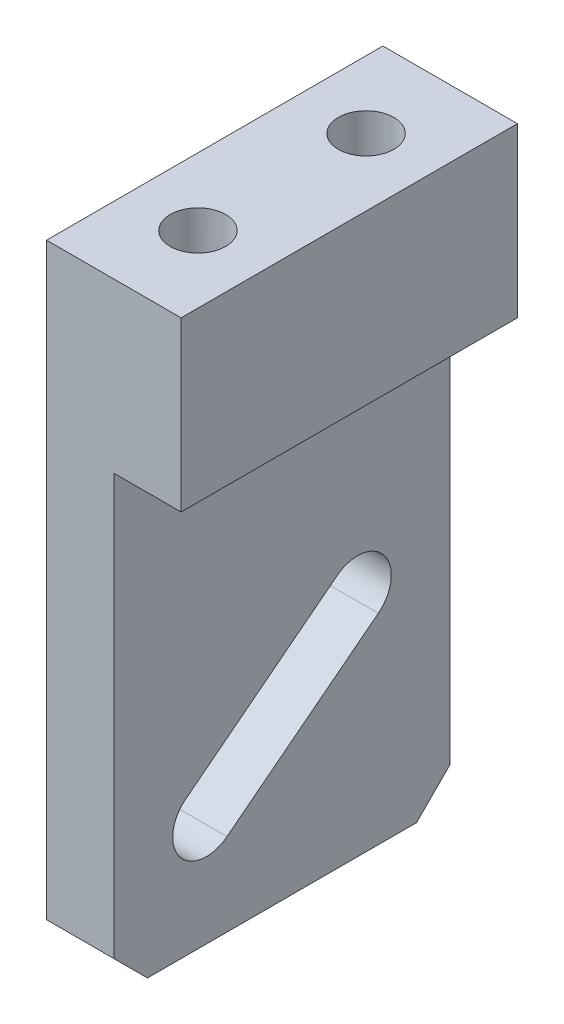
ISO-10303-21;
HEADER;
FILE_DESCRIPTION(('STEP AP214'),'2;1');
FILE_NAME('part.step','',(''),(''),'','','');
FILE_SCHEMA(('AUTOMOTIVE_DESIGN { 1 0 10303 214 1 1 1 1 }'));
ENDSEC;
DATA;
#1=APPLICATION_CONTEXT('core data for automotive mechanical design processes');
#2=APPLICATION_PROTOCOL_DEFINITION('international standard','automotive_design',2000,#1);
#3=PRODUCT_CONTEXT('',#1,'mechanical');
#4=PRODUCT('Part','Part','',(#3));
#5=PRODUCT_RELATED_PRODUCT_CATEGORY('part','',(#4));
#6=PRODUCT_DEFINITION_FORMATION('','',#4);
#7=PRODUCT_DEFINITION_CONTEXT('part definition',#1,'design');
#8=PRODUCT_DEFINITION('design','',#6,#7);
#9=PRODUCT_DEFINITION_SHAPE('','',#8);
#10=(LENGTH_UNIT() NAMED_UNIT(*) SI_UNIT(.MILLI.,.METRE.));
#11=(NAMED_UNIT(*) PLANE_ANGLE_UNIT() SI_UNIT($,.RADIAN.));
#12=(NAMED_UNIT(*) SI_UNIT($,.STERADIAN.) SOLID_ANGLE_UNIT());
#13=UNCERTAINTY_MEASURE_WITH_UNIT(LENGTH_MEASURE(1.E-05),#10,'distance_accuracy_value','');
#14=(GEOMETRIC_REPRESENTATION_CONTEXT(3) GLOBAL_UNCERTAINTY_ASSIGNED_CONTEXT((#13)) GLOBAL_UNIT_ASSIGNED_CONTEXT((#10,
#11,#12)) REPRESENTATION_CONTEXT('',''));
#15=CARTESIAN_POINT('',(0.,0.,0.));
#16=DIRECTION('',(0.,0.,1.));
#17=DIRECTION('',(1.,0.,0.));
#18=AXIS2_PLACEMENT_3D('',#15,#16,#17);
#19=CARTESIAN_POINT('',(-26.,13.5,-4.5));
#20=DIRECTION('',(1.,0.,0.));
#21=DIRECTION('',(0.,0.,-1.));
#22=AXIS2_PLACEMENT_3D('',#19,#20,#21);
#23=CYLINDRICAL_SURFACE('',#22,2.);
#24=DIRECTION('',(1.,0.,0.));
#25=VECTOR('',#24,1.);
#26=CARTESIAN_POINT('',(-26.,11.9212955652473,-5.72788122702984));
#27=LINE('',#26,#25);
#28=CARTESIAN_POINT('',(0.,11.9212955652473,-5.72788122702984));
#29=VERTEX_POINT('',#28);
#30=CARTESIAN_POINT('',(-4.,11.9212955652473,-5.72788122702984));
#31=VERTEX_POINT('',#30);
#32=EDGE_CURVE('E182',#29,#31,#27,.F.);
#33=ORIENTED_EDGE('',*,*,#32,.F.);
#34=CARTESIAN_POINT('',(0.,13.5,-4.5));
#35=DIRECTION('',(-1.,0.,0.));
#36=DIRECTION('',(0.,0.,1.));
#37=AXIS2_PLACEMENT_3D('',#34,#35,#36);
#38=CIRCLE('',#37,2.);
#39=CARTESIAN_POINT('',(0.,15.0787044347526,-3.27211877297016));
#40=VERTEX_POINT('',#39);
#41=EDGE_CURVE('E31',#29,#40,#38,.F.);
#42=ORIENTED_EDGE('',*,*,#41,.T.);
#43=DIRECTION('',(1.,0.,0.));
#44=VECTOR('',#43,1.);
#45=CARTESIAN_POINT('',(-26.,15.0787044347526,-3.27211877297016));
#46=LINE('',#45,#44);
#47=CARTESIAN_POINT('',(-4.,15.0787044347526,-3.27211877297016));
#48=VERTEX_POINT('',#47);
#49=EDGE_CURVE('E174',#40,#48,#46,.F.);
#50=ORIENTED_EDGE('',*,*,#49,.T.);
#51=CARTESIAN_POINT('',(-4.,13.5,-4.5));
#52=DIRECTION('',(1.,0.,0.));
#53=DIRECTION('',(0.,0.,-1.));
#54=AXIS2_PLACEMENT_3D('',#51,#52,#53);
#55=CIRCLE('',#54,2.);
#56=EDGE_CURVE('E177',#31,#48,#55,.T.);
#57=ORIENTED_EDGE('',*,*,#56,.F.);
#58=EDGE_LOOP('',(#33,#42,#50,#57));
#59=FACE_BOUND('',#58,.T.);
#60=ADVANCED_FACE('F16',(#59),#23,.F.);
#61=CARTESIAN_POINT('',(4.,39.,10.));
#62=DIRECTION('',(-1.,0.,0.));
#63=DIRECTION('',(0.,0.,1.));
#64=AXIS2_PLACEMENT_3D('',#61,#62,#63);
#65=PLANE('',#64);
#66=DIRECTION('',(0.,-1.,0.));
#67=VECTOR('',#66,1.);
#68=CARTESIAN_POINT('',(4.,39.,10.));
#69=LINE('',#68,#67);
#70=CARTESIAN_POINT('',(4.,37.,10.));
#71=VERTEX_POINT('',#70);
#72=CARTESIAN_POINT('',(4.,27.,10.));
#73=VERTEX_POINT('',#72);
#74=EDGE_CURVE('E155',#71,#73,#69,.T.);
#75=ORIENTED_EDGE('',*,*,#74,.T.);
#76=DIRECTION('',(0.,0.,1.));
#77=VECTOR('',#76,1.);
#78=CARTESIAN_POINT('',(4.,27.,-29.));
#79=LINE('',#78,#77);
#80=CARTESIAN_POINT('',(4.,27.,-10.));
#81=VERTEX_POINT('',#80);
#82=EDGE_CURVE('E135',#81,#73,#79,.T.);
#83=ORIENTED_EDGE('',*,*,#82,.F.);
#84=DIRECTION('',(0.,-1.,0.));
#85=VECTOR('',#84,1.);
#86=CARTESIAN_POINT('',(4.,39.,-10.));
#87=LINE('',#86,#85);
#88=CARTESIAN_POINT('',(4.,37.,-10.));
#89=VERTEX_POINT('',#88);
#90=EDGE_CURVE('E172',#89,#81,#87,.T.);
#91=ORIENTED_EDGE('',*,*,#90,.F.);
#92=DIRECTION('',(0.,0.,1.));
#93=VECTOR('',#92,1.);
#94=CARTESIAN_POINT('',(4.,37.,10.));
#95=LINE('',#94,#93);
#96=EDGE_CURVE('E159',#89,#71,#95,.T.);
#97=ORIENTED_EDGE('',*,*,#96,.T.);
#98=EDGE_LOOP('',(#75,#83,#91,#97));
#99=FACE_BOUND('',#98,.T.);
#100=ADVANCED_FACE('F158',(#99),#65,.F.);
#101=CARTESIAN_POINT('',(-4.,39.,-10.));
#102=DIRECTION('',(0.,0.,1.));
#103=DIRECTION('',(1.,0.,0.));
#104=AXIS2_PLACEMENT_3D('',#101,#102,#103);
#105=PLANE('',#104);
#106=DIRECTION('',(-1.,0.,0.));
#107=VECTOR('',#106,1.);
#108=CARTESIAN_POINT('',(-4.,27.,-10.));
#109=LINE('',#108,#107);
#110=CARTESIAN_POINT('',(0.,27.,-10.));
#111=VERTEX_POINT('',#110);
#112=EDGE_CURVE('E142',#81,#111,#109,.T.);
#113=ORIENTED_EDGE('',*,*,#112,.T.);
#114=DIRECTION('',(0.,-1.,0.));
#115=VECTOR('',#114,1.);
#116=CARTESIAN_POINT('',(0.,39.,-10.));
#117=LINE('',#116,#115);
#118=CARTESIAN_POINT('',(0.,2.,-10.));
#119=VERTEX_POINT('',#118);
#120=EDGE_CURVE('E238',#111,#119,#117,.T.);
#121=ORIENTED_EDGE('',*,*,#120,.T.);
#122=DIRECTION('',(-1.,0.,0.));
#123=VECTOR('',#122,1.);
#124=CARTESIAN_POINT('',(-4.,2.,-10.));
#125=LINE('',#124,#123);
#126=CARTESIAN_POINT('',(-4.,2.,-10.));
#127=VERTEX_POINT('',#126);
#128=EDGE_CURVE('E196',#119,#127,#125,.T.);
#129=ORIENTED_EDGE('',*,*,#128,.T.);
#130=DIRECTION('',(0.,-1.,0.));
#131=VECTOR('',#130,1.);
#132=CARTESIAN_POINT('',(-4.,39.,-10.));
#133=LINE('',#132,#131);
#134=CARTESIAN_POINT('',(-4.,37.,-10.));
#135=VERTEX_POINT('',#134);
#136=EDGE_CURVE('E163',#135,#127,#133,.T.);
#137=ORIENTED_EDGE('',*,*,#136,.F.);
#138=DIRECTION('',(1.,0.,0.));
#139=VECTOR('',#138,1.);
#140=CARTESIAN_POINT('',(-4.,37.,-10.));
#141=LINE('',#140,#139);
#142=EDGE_CURVE('E265',#135,#89,#141,.T.);
#143=ORIENTED_EDGE('',*,*,#142,.T.);
#144=ORIENTED_EDGE('',*,*,#90,.T.);
#145=EDGE_LOOP('',(#113,#121,#129,#137,#143,#144));
#146=FACE_BOUND('',#145,.T.);
#147=ADVANCED_FACE('F310',(#146),#105,.F.);
#148=CARTESIAN_POINT('',(-4.,39.,10.));
#149=DIRECTION('',(1.,0.,0.));
#150=DIRECTION('',(0.,0.,-1.));
#151=AXIS2_PLACEMENT_3D('',#148,#149,#150);
#152=PLANE('',#151);
#153=CARTESIAN_POINT('',(-4.,6.5,4.5));
#154=DIRECTION('',(1.,0.,0.));
#155=DIRECTION('',(0.,0.,-1.));
#156=AXIS2_PLACEMENT_3D('',#153,#154,#155);
#157=CIRCLE('',#156,2.);
#158=CARTESIAN_POINT('',(-4.,8.07870443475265,5.72788122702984));
#159=VERTEX_POINT('',#158);
#160=CARTESIAN_POINT('',(-4.,4.92129556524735,3.27211877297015));
#161=VERTEX_POINT('',#160);
#162=EDGE_CURVE('E166',#159,#161,#157,.T.);
#163=ORIENTED_EDGE('',*,*,#162,.T.);
#164=DIRECTION('',(0.,0.613940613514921,-0.789352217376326));
#165=VECTOR('',#164,1.);
#166=CARTESIAN_POINT('',(-4.,14.5059109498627,-9.05095815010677));
#167=LINE('',#166,#165);
#168=EDGE_CURVE('E180',#161,#31,#167,.T.);
#169=ORIENTED_EDGE('',*,*,#168,.T.);
#170=ORIENTED_EDGE('',*,*,#56,.T.);
#171=DIRECTION('',(0.,-0.613940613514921,0.789352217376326));
#172=VECTOR('',#171,1.);
#173=CARTESIAN_POINT('',(-4.,17.6633198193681,-6.59519569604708));
#174=LINE('',#173,#172);
#175=EDGE_CURVE('E273',#48,#159,#174,.T.);
#176=ORIENTED_EDGE('',*,*,#175,.T.);
#177=EDGE_LOOP('',(#163,#169,#170,#176));
#178=FACE_BOUND('',#177,.T.);
#179=DIRECTION('',(0.,-1.,0.));
#180=VECTOR('',#179,1.);
#181=CARTESIAN_POINT('',(-4.,39.,10.));
#182=LINE('',#181,#180);
#183=CARTESIAN_POINT('',(-4.,37.,10.));
#184=VERTEX_POINT('',#183);
#185=CARTESIAN_POINT('',(-4.,2.,10.));
#186=VERTEX_POINT('',#185);
#187=EDGE_CURVE('E160',#184,#186,#182,.T.);
#188=ORIENTED_EDGE('',*,*,#187,.F.);
#189=DIRECTION('',(0.,0.,-1.));
#190=VECTOR('',#189,1.);
#191=CARTESIAN_POINT('',(-4.,37.,10.));
#192=LINE('',#191,#190);
#193=EDGE_CURVE('E262',#184,#135,#192,.T.);
#194=ORIENTED_EDGE('',*,*,#193,.T.);
#195=ORIENTED_EDGE('',*,*,#136,.T.);
#196=DIRECTION('',(0.,-0.707106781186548,0.707106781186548));
#197=VECTOR('',#196,1.);
#198=CARTESIAN_POINT('',(-4.,2.,-10.));
#199=LINE('',#198,#197);
#200=CARTESIAN_POINT('',(-4.,0.,-8.));
#201=VERTEX_POINT('',#200);
#202=EDGE_CURVE('E191',#127,#201,#199,.T.);
#203=ORIENTED_EDGE('',*,*,#202,.T.);
#204=DIRECTION('',(0.,0.,1.));
#205=VECTOR('',#204,1.);
#206=CARTESIAN_POINT('',(-4.,0.,10.));
#207=LINE('',#206,#205);
#208=CARTESIAN_POINT('',(-4.,0.,8.));
#209=VERTEX_POINT('',#208);
#210=EDGE_CURVE('E161',#201,#209,#207,.T.);
#211=ORIENTED_EDGE('',*,*,#210,.T.);
#212=DIRECTION('',(0.,0.707106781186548,0.707106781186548));
#213=VECTOR('',#212,1.);
#214=CARTESIAN_POINT('',(-4.,2.,10.));
#215=LINE('',#214,#213);
#216=EDGE_CURVE('E193',#209,#186,#215,.T.);
#217=ORIENTED_EDGE('',*,*,#216,.T.);
#218=EDGE_LOOP('',(#188,#194,#195,#203,#211,#217));
#219=FACE_BOUND('',#218,.T.);
#220=ADVANCED_FACE('F280',(#178,#219),#152,.F.);
#221=CARTESIAN_POINT('',(-4.,39.,10.));
#222=DIRECTION('',(0.,0.,-1.));
#223=DIRECTION('',(-1.,0.,0.));
#224=AXIS2_PLACEMENT_3D('',#221,#222,#223);
#225=PLANE('',#224);
#226=DIRECTION('',(1.,0.,0.));
#227=VECTOR('',#226,1.);
#228=CARTESIAN_POINT('',(4.,2.,10.));
#229=LINE('',#228,#227);
#230=CARTESIAN_POINT('',(0.,2.,10.));
#231=VERTEX_POINT('',#230);
#232=EDGE_CURVE('E184',#186,#231,#229,.T.);
#233=ORIENTED_EDGE('',*,*,#232,.T.);
#234=DIRECTION('',(0.,-1.,0.));
#235=VECTOR('',#234,1.);
#236=CARTESIAN_POINT('',(0.,0.,10.));
#237=LINE('',#236,#235);
#238=CARTESIAN_POINT('',(0.,27.,10.));
#239=VERTEX_POINT('',#238);
#240=EDGE_CURVE('E148',#239,#231,#237,.T.);
#241=ORIENTED_EDGE('',*,*,#240,.F.);
#242=DIRECTION('',(-1.,0.,0.));
#243=VECTOR('',#242,1.);
#244=CARTESIAN_POINT('',(4.,27.,10.));
#245=LINE('',#244,#243);
#246=EDGE_CURVE('E138',#73,#239,#245,.T.);
#247=ORIENTED_EDGE('',*,*,#246,.F.);
#248=ORIENTED_EDGE('',*,*,#74,.F.);
#249=DIRECTION('',(-1.,0.,0.));
#250=VECTOR('',#249,1.);
#251=CARTESIAN_POINT('',(-4.,37.,10.));
#252=LINE('',#251,#250);
#253=EDGE_CURVE('E198',#71,#184,#252,.T.);
#254=ORIENTED_EDGE('',*,*,#253,.T.);
#255=ORIENTED_EDGE('',*,*,#187,.T.);
#256=EDGE_LOOP('',(#233,#241,#247,#248,#254,#255));
#257=FACE_BOUND('',#256,.T.);
#258=ADVANCED_FACE('F153',(#257),#225,.F.);
#259=CARTESIAN_POINT('',(0.,0.,0.));
#260=DIRECTION('',(0.,-1.,0.));
#261=DIRECTION('',(0.,0.,-1.));
#262=AXIS2_PLACEMENT_3D('',#259,#260,#261);
#263=PLANE('',#262);
#264=DIRECTION('',(0.,0.,1.));
#265=VECTOR('',#264,1.);
#266=CARTESIAN_POINT('',(0.,0.,-29.));
#267=LINE('',#266,#265);
#268=CARTESIAN_POINT('',(0.,0.,-8.));
#269=VERTEX_POINT('',#268);
#270=CARTESIAN_POINT('',(0.,0.,8.));
#271=VERTEX_POINT('',#270);
#272=EDGE_CURVE('E39',#269,#271,#267,.T.);
#273=ORIENTED_EDGE('',*,*,#272,.T.);
#274=DIRECTION('',(-1.,0.,0.));
#275=VECTOR('',#274,1.);
#276=CARTESIAN_POINT('',(-4.,0.,8.));
#277=LINE('',#276,#275);
#278=EDGE_CURVE('E189',#271,#209,#277,.T.);
#279=ORIENTED_EDGE('',*,*,#278,.T.);
#280=ORIENTED_EDGE('',*,*,#210,.F.);
#281=DIRECTION('',(1.,0.,0.));
#282=VECTOR('',#281,1.);
#283=CARTESIAN_POINT('',(4.,0.,-8.));
#284=LINE('',#283,#282);
#285=EDGE_CURVE('E186',#201,#269,#284,.T.);
#286=ORIENTED_EDGE('',*,*,#285,.T.);
#287=EDGE_LOOP('',(#273,#279,#280,#286));
#288=FACE_BOUND('',#287,.T.);
#289=ADVANCED_FACE('F317',(#288),#263,.T.);
#290=CARTESIAN_POINT('',(-26.,6.5,4.5));
#291=DIRECTION('',(1.,0.,0.));
#292=DIRECTION('',(0.,0.,-1.));
#293=AXIS2_PLACEMENT_3D('',#290,#291,#292);
#294=CYLINDRICAL_SURFACE('',#293,2.);
#295=DIRECTION('',(1.,0.,0.));
#296=VECTOR('',#295,1.);
#297=CARTESIAN_POINT('',(-26.,8.07870443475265,5.72788122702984));
#298=LINE('',#297,#296);
#299=CARTESIAN_POINT('',(0.,8.07870443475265,5.72788122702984));
#300=VERTEX_POINT('',#299);
#301=EDGE_CURVE('E269',#159,#300,#298,.T.);
#302=ORIENTED_EDGE('',*,*,#301,.T.);
#303=CARTESIAN_POINT('',(0.,6.5,4.5));
#304=DIRECTION('',(-1.,0.,0.));
#305=DIRECTION('',(0.,0.,1.));
#306=AXIS2_PLACEMENT_3D('',#303,#304,#305);
#307=CIRCLE('',#306,2.);
#308=CARTESIAN_POINT('',(0.,4.92129556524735,3.27211877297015));
#309=VERTEX_POINT('',#308);
#310=EDGE_CURVE('E245',#300,#309,#307,.F.);
#311=ORIENTED_EDGE('',*,*,#310,.T.);
#312=DIRECTION('',(1.,0.,0.));
#313=VECTOR('',#312,1.);
#314=CARTESIAN_POINT('',(-26.,4.92129556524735,3.27211877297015));
#315=LINE('',#314,#313);
#316=EDGE_CURVE('E270',#161,#309,#315,.T.);
#317=ORIENTED_EDGE('',*,*,#316,.F.);
#318=ORIENTED_EDGE('',*,*,#162,.F.);
#319=EDGE_LOOP('',(#302,#311,#317,#318));
#320=FACE_BOUND('',#319,.T.);
#321=ADVANCED_FACE('F292',(#320),#294,.F.);
#322=CARTESIAN_POINT('',(-26.,15.0787044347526,-3.27211877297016));
#323=DIRECTION('',(0.,0.789352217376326,0.613940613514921));
#324=DIRECTION('',(0.,-0.613940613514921,0.789352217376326));
#325=AXIS2_PLACEMENT_3D('',#322,#323,#324);
#326=PLANE('',#325);
#327=ORIENTED_EDGE('',*,*,#49,.F.);
#328=DIRECTION('',(0.,-0.613940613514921,0.789352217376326));
#329=VECTOR('',#328,1.);
#330=CARTESIAN_POINT('',(0.,15.0787044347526,-3.27211877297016));
#331=LINE('',#330,#329);
#332=EDGE_CURVE('E249',#40,#300,#331,.T.);
#333=ORIENTED_EDGE('',*,*,#332,.T.);
#334=ORIENTED_EDGE('',*,*,#301,.F.);
#335=ORIENTED_EDGE('',*,*,#175,.F.);
#336=EDGE_LOOP('',(#327,#333,#334,#335));
#337=FACE_BOUND('',#336,.T.);
#338=ADVANCED_FACE('F290',(#337),#326,.F.);
#339=CARTESIAN_POINT('',(-26.,11.9212955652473,-5.72788122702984));
#340=DIRECTION('',(0.,-0.789352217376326,-0.613940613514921));
#341=DIRECTION('',(0.,0.613940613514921,-0.789352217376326));
#342=AXIS2_PLACEMENT_3D('',#339,#340,#341);
#343=PLANE('',#342);
#344=ORIENTED_EDGE('',*,*,#316,.T.);
#345=DIRECTION('',(0.,0.613940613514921,-0.789352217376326));
#346=VECTOR('',#345,1.);
#347=CARTESIAN_POINT('',(0.,11.9212955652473,-5.72788122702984));
#348=LINE('',#347,#346);
#349=EDGE_CURVE('E243',#309,#29,#348,.T.);
#350=ORIENTED_EDGE('',*,*,#349,.T.);
#351=ORIENTED_EDGE('',*,*,#32,.T.);
#352=ORIENTED_EDGE('',*,*,#168,.F.);
#353=EDGE_LOOP('',(#344,#350,#351,#352));
#354=FACE_BOUND('',#353,.T.);
#355=ADVANCED_FACE('F293',(#354),#343,.F.);
#356=CARTESIAN_POINT('',(-4.,2.,10.));
#357=DIRECTION('',(0.,-0.707106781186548,0.707106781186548));
#358=DIRECTION('',(-1.,0.,0.));
#359=AXIS2_PLACEMENT_3D('',#356,#357,#358);
#360=PLANE('',#359);
#361=DIRECTION('',(0.,-0.707106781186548,-0.707106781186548));
#362=VECTOR('',#361,1.);
#363=CARTESIAN_POINT('',(0.,2.,10.));
#364=LINE('',#363,#362);
#365=EDGE_CURVE('E241',#231,#271,#364,.T.);
#366=ORIENTED_EDGE('',*,*,#365,.F.);
#367=ORIENTED_EDGE('',*,*,#232,.F.);
#368=ORIENTED_EDGE('',*,*,#216,.F.);
#369=ORIENTED_EDGE('',*,*,#278,.F.);
#370=EDGE_LOOP('',(#366,#367,#368,#369));
#371=FACE_BOUND('',#370,.T.);
#372=ADVANCED_FACE('F327',(#371),#360,.T.);
#373=CARTESIAN_POINT('',(-4.,2.,-10.));
#374=DIRECTION('',(0.,-0.707106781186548,-0.707106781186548));
#375=DIRECTION('',(1.,0.,0.));
#376=AXIS2_PLACEMENT_3D('',#373,#374,#375);
#377=PLANE('',#376);
#378=DIRECTION('',(0.,0.707106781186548,-0.707106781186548));
#379=VECTOR('',#378,1.);
#380=CARTESIAN_POINT('',(0.,2.,-10.));
#381=LINE('',#380,#379);
#382=EDGE_CURVE('E236',#269,#119,#381,.T.);
#383=ORIENTED_EDGE('',*,*,#382,.F.);
#384=ORIENTED_EDGE('',*,*,#285,.F.);
#385=ORIENTED_EDGE('',*,*,#202,.F.);
#386=ORIENTED_EDGE('',*,*,#128,.F.);
#387=EDGE_LOOP('',(#383,#384,#385,#386));
#388=FACE_BOUND('',#387,.T.);
#389=ADVANCED_FACE('F18',(#388),#377,.T.);
#390=CARTESIAN_POINT('',(0.,37.,0.));
#391=DIRECTION('',(0.,-1.,0.));
#392=DIRECTION('',(0.,0.,-1.));
#393=AXIS2_PLACEMENT_3D('',#390,#391,#392);
#394=PLANE('',#393);
#395=CARTESIAN_POINT('',(0.,37.,-5.));
#396=DIRECTION('',(0.,1.,0.));
#397=DIRECTION('',(0.,0.,1.));
#398=AXIS2_PLACEMENT_3D('',#395,#396,#397);
#399=CIRCLE('',#398,1.65);
#400=CARTESIAN_POINT('',(0.,37.,-3.35));
#401=VERTEX_POINT('',#400);
#402=EDGE_CURVE('E252',#401,#401,#399,.T.);
#403=ORIENTED_EDGE('',*,*,#402,.F.);
#404=EDGE_LOOP('',(#403));
#405=FACE_BOUND('',#404,.T.);
#406=CARTESIAN_POINT('',(0.,37.,5.));
#407=DIRECTION('',(0.,1.,0.));
#408=DIRECTION('',(0.,0.,1.));
#409=AXIS2_PLACEMENT_3D('',#406,#407,#408);
#410=CIRCLE('',#409,1.65);
#411=CARTESIAN_POINT('',(0.,37.,6.65));
#412=VERTEX_POINT('',#411);
#413=EDGE_CURVE('E256',#412,#412,#410,.T.);
#414=ORIENTED_EDGE('',*,*,#413,.F.);
#415=EDGE_LOOP('',(#414));
#416=FACE_BOUND('',#415,.T.);
#417=ORIENTED_EDGE('',*,*,#142,.F.);
#418=ORIENTED_EDGE('',*,*,#193,.F.);
#419=ORIENTED_EDGE('',*,*,#253,.F.);
#420=ORIENTED_EDGE('',*,*,#96,.F.);
#421=EDGE_LOOP('',(#417,#418,#419,#420));
#422=FACE_BOUND('',#421,.T.);
#423=ADVANCED_FACE('F335',(#405,#416,#422),#394,.F.);
#424=CARTESIAN_POINT('',(0.,26.9,5.));
#425=DIRECTION('',(0.,1.,0.));
#426=DIRECTION('',(0.,0.,1.));
#427=AXIS2_PLACEMENT_3D('',#424,#425,#426);
#428=CONICAL_SURFACE('',#427,1.65,1.02974425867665);
#429=CARTESIAN_POINT('',(0.,26.9,5.));
#430=DIRECTION('',(0.,1.,0.));
#431=DIRECTION('',(0.,0.,1.));
#432=AXIS2_PLACEMENT_3D('',#429,#430,#431);
#433=CIRCLE('',#432,1.65);
#434=CARTESIAN_POINT('',(0.,26.9,3.35));
#435=VERTEX_POINT('',#434);
#436=CARTESIAN_POINT('',(0.,26.9,6.65));
#437=VERTEX_POINT('',#436);
#438=EDGE_CURVE('E259',#435,#437,#433,.T.);
#439=ORIENTED_EDGE('',*,*,#438,.T.);
#440=DIRECTION('',(0.,0.515038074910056,0.857167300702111));
#441=VECTOR('',#440,1.);
#442=CARTESIAN_POINT('',(0.,25.9085799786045,5.));
#443=LINE('',#442,#441);
#444=CARTESIAN_POINT('',(0.,25.9085799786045,5.));
#445=VERTEX_POINT('',#444);
#446=EDGE_CURVE('E230',#437,#445,#443,.F.);
#447=ORIENTED_EDGE('',*,*,#446,.T.);
#448=DIRECTION('',(0.,-0.515038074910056,0.857167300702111));
#449=VECTOR('',#448,1.);
#450=CARTESIAN_POINT('',(0.,25.9085799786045,5.));
#451=LINE('',#450,#449);
#452=EDGE_CURVE('E227',#445,#435,#451,.F.);
#453=ORIENTED_EDGE('',*,*,#452,.T.);
#454=EDGE_LOOP('',(#439,#447,#453));
#455=FACE_BOUND('',#454,.T.);
#456=ADVANCED_FACE('F349',(#455),#428,.F.);
#457=CARTESIAN_POINT('',(0.,37.,5.));
#458=DIRECTION('',(0.,1.,0.));
#459=DIRECTION('',(0.,0.,1.));
#460=AXIS2_PLACEMENT_3D('',#457,#458,#459);
#461=CYLINDRICAL_SURFACE('',#460,1.65);
#462=CARTESIAN_POINT('',(0.,27.,5.));
#463=DIRECTION('',(0.,1.,0.));
#464=DIRECTION('',(0.,0.,1.));
#465=AXIS2_PLACEMENT_3D('',#462,#463,#464);
#466=CIRCLE('',#465,1.65);
#467=CARTESIAN_POINT('',(0.,27.,3.35));
#468=VERTEX_POINT('',#467);
#469=CARTESIAN_POINT('',(0.,27.,6.65));
#470=VERTEX_POINT('',#469);
#471=EDGE_CURVE('E221',#468,#470,#466,.F.);
#472=ORIENTED_EDGE('',*,*,#471,.T.);
#473=DIRECTION('',(0.,1.,0.));
#474=VECTOR('',#473,1.);
#475=CARTESIAN_POINT('',(0.,37.,6.65));
#476=LINE('',#475,#474);
#477=EDGE_CURVE('E233',#470,#437,#476,.F.);
#478=ORIENTED_EDGE('',*,*,#477,.T.);
#479=ORIENTED_EDGE('',*,*,#438,.F.);
#480=DIRECTION('',(0.,1.,0.));
#481=VECTOR('',#480,1.);
#482=CARTESIAN_POINT('',(0.,37.,3.35));
#483=LINE('',#482,#481);
#484=EDGE_CURVE('E219',#435,#468,#483,.T.);
#485=ORIENTED_EDGE('',*,*,#484,.T.);
#486=EDGE_LOOP('',(#472,#478,#479,#485));
#487=FACE_BOUND('',#486,.T.);
#488=ORIENTED_EDGE('',*,*,#413,.T.);
#489=EDGE_LOOP('',(#488));
#490=FACE_BOUND('',#489,.T.);
#491=ADVANCED_FACE('F356',(#487,#490),#461,.F.);
#492=CARTESIAN_POINT('',(0.,26.9,-5.));
#493=DIRECTION('',(0.,1.,0.));
#494=DIRECTION('',(0.,0.,1.));
#495=AXIS2_PLACEMENT_3D('',#492,#493,#494);
#496=CONICAL_SURFACE('',#495,1.65,1.02974425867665);
#497=CARTESIAN_POINT('',(0.,26.9,-5.));
#498=DIRECTION('',(0.,1.,0.));
#499=DIRECTION('',(0.,0.,1.));
#500=AXIS2_PLACEMENT_3D('',#497,#498,#499);
#501=CIRCLE('',#500,1.65);
#502=CARTESIAN_POINT('',(0.,26.9,-6.65));
#503=VERTEX_POINT('',#502);
#504=CARTESIAN_POINT('',(0.,26.9,-3.35));
#505=VERTEX_POINT('',#504);
#506=EDGE_CURVE('E208',#503,#505,#501,.T.);
#507=ORIENTED_EDGE('',*,*,#506,.T.);
#508=DIRECTION('',(0.,0.515038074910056,0.857167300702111));
#509=VECTOR('',#508,1.);
#510=CARTESIAN_POINT('',(0.,25.9085799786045,-5.));
#511=LINE('',#510,#509);
#512=CARTESIAN_POINT('',(0.,25.9085799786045,-5.));
#513=VERTEX_POINT('',#512);
#514=EDGE_CURVE('E217',#505,#513,#511,.F.);
#515=ORIENTED_EDGE('',*,*,#514,.T.);
#516=DIRECTION('',(0.,-0.515038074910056,0.857167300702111));
#517=VECTOR('',#516,1.);
#518=CARTESIAN_POINT('',(0.,25.9085799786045,-5.));
#519=LINE('',#518,#517);
#520=EDGE_CURVE('E212',#513,#503,#519,.F.);
#521=ORIENTED_EDGE('',*,*,#520,.T.);
#522=EDGE_LOOP('',(#507,#515,#521));
#523=FACE_BOUND('',#522,.T.);
#524=ADVANCED_FACE('F216',(#523),#496,.F.);
#525=CARTESIAN_POINT('',(0.,37.,-5.));
#526=DIRECTION('',(0.,1.,0.));
#527=DIRECTION('',(0.,0.,1.));
#528=AXIS2_PLACEMENT_3D('',#525,#526,#527);
#529=CYLINDRICAL_SURFACE('',#528,1.65);
#530=CARTESIAN_POINT('',(0.,27.,-5.));
#531=DIRECTION('',(0.,1.,0.));
#532=DIRECTION('',(0.,0.,1.));
#533=AXIS2_PLACEMENT_3D('',#530,#531,#532);
#534=CIRCLE('',#533,1.65);
#535=CARTESIAN_POINT('',(0.,27.,-6.65));
#536=VERTEX_POINT('',#535);
#537=CARTESIAN_POINT('',(0.,27.,-3.35));
#538=VERTEX_POINT('',#537);
#539=EDGE_CURVE('E200',#536,#538,#534,.F.);
#540=ORIENTED_EDGE('',*,*,#539,.T.);
#541=DIRECTION('',(0.,1.,0.));
#542=VECTOR('',#541,1.);
#543=CARTESIAN_POINT('',(0.,37.,-3.35));
#544=LINE('',#543,#542);
#545=EDGE_CURVE('E11',#538,#505,#544,.F.);
#546=ORIENTED_EDGE('',*,*,#545,.T.);
#547=ORIENTED_EDGE('',*,*,#506,.F.);
#548=DIRECTION('',(0.,1.,0.));
#549=VECTOR('',#548,1.);
#550=CARTESIAN_POINT('',(0.,37.,-6.65));
#551=LINE('',#550,#549);
#552=EDGE_CURVE('E24',#503,#536,#551,.T.);
#553=ORIENTED_EDGE('',*,*,#552,.T.);
#554=EDGE_LOOP('',(#540,#546,#547,#553));
#555=FACE_BOUND('',#554,.T.);
#556=ORIENTED_EDGE('',*,*,#402,.T.);
#557=EDGE_LOOP('',(#556));
#558=FACE_BOUND('',#557,.T.);
#559=ADVANCED_FACE('F205',(#555,#558),#529,.F.);
#560=CARTESIAN_POINT('',(0.,0.,-29.));
#561=DIRECTION('',(-1.,0.,0.));
#562=DIRECTION('',(0.,0.,1.));
#563=AXIS2_PLACEMENT_3D('',#560,#561,#562);
#564=PLANE('',#563);
#565=ORIENTED_EDGE('',*,*,#365,.T.);
#566=ORIENTED_EDGE('',*,*,#272,.F.);
#567=ORIENTED_EDGE('',*,*,#382,.T.);
#568=ORIENTED_EDGE('',*,*,#120,.F.);
#569=DIRECTION('',(0.,0.,1.));
#570=VECTOR('',#569,1.);
#571=CARTESIAN_POINT('',(0.,27.,-29.));
#572=LINE('',#571,#570);
#573=EDGE_CURVE('E214',#111,#536,#572,.T.);
#574=ORIENTED_EDGE('',*,*,#573,.T.);
#575=ORIENTED_EDGE('',*,*,#552,.F.);
#576=ORIENTED_EDGE('',*,*,#520,.F.);
#577=ORIENTED_EDGE('',*,*,#514,.F.);
#578=ORIENTED_EDGE('',*,*,#545,.F.);
#579=EDGE_CURVE('E478',#538,#468,#572,.T.);
#580=ORIENTED_EDGE('',*,*,#579,.T.);
#581=ORIENTED_EDGE('',*,*,#484,.F.);
#582=ORIENTED_EDGE('',*,*,#452,.F.);
#583=ORIENTED_EDGE('',*,*,#446,.F.);
#584=ORIENTED_EDGE('',*,*,#477,.F.);
#585=EDGE_CURVE('E147',#470,#239,#572,.T.);
#586=ORIENTED_EDGE('',*,*,#585,.T.);
#587=ORIENTED_EDGE('',*,*,#240,.T.);
#588=EDGE_LOOP('',(#565,#566,#567,#568,#574,#575,#576,#577,#578,#580,#581,#582,#583,#584,#586,#587));
#589=FACE_BOUND('',#588,.T.);
#590=ORIENTED_EDGE('',*,*,#41,.F.);
#591=ORIENTED_EDGE('',*,*,#349,.F.);
#592=ORIENTED_EDGE('',*,*,#310,.F.);
#593=ORIENTED_EDGE('',*,*,#332,.F.);
#594=EDGE_LOOP('',(#590,#591,#592,#593));
#595=FACE_BOUND('',#594,.T.);
#596=ADVANCED_FACE('F211',(#589,#595),#564,.F.);
#597=CARTESIAN_POINT('',(4.,27.,-29.));
#598=DIRECTION('',(0.,1.,0.));
#599=DIRECTION('',(0.,0.,1.));
#600=AXIS2_PLACEMENT_3D('',#597,#598,#599);
#601=PLANE('',#600);
#602=ORIENTED_EDGE('',*,*,#82,.T.);
#603=ORIENTED_EDGE('',*,*,#246,.T.);
#604=ORIENTED_EDGE('',*,*,#585,.F.);
#605=ORIENTED_EDGE('',*,*,#471,.F.);
#606=ORIENTED_EDGE('',*,*,#579,.F.);
#607=ORIENTED_EDGE('',*,*,#539,.F.);
#608=ORIENTED_EDGE('',*,*,#573,.F.);
#609=ORIENTED_EDGE('',*,*,#112,.F.);
#610=EDGE_LOOP('',(#602,#603,#604,#605,#606,#607,#608,#609));
#611=FACE_BOUND('',#610,.T.);
#612=ADVANCED_FACE('F137',(#611),#601,.F.);
#613=CLOSED_SHELL('',(#60,#100,#147,#220,#258,#289,#321,#338,#355,#372,#389,#423,#456,#491,#524,
#559,#596,#612));
#614=MANIFOLD_SOLID_BREP('B1',#613);
#615=ADVANCED_BREP_SHAPE_REPRESENTATION('',(#18,#614),#14);
#616=SHAPE_DEFINITION_REPRESENTATION(#9,#615);
ENDSEC;
END-ISO-10303-21;
